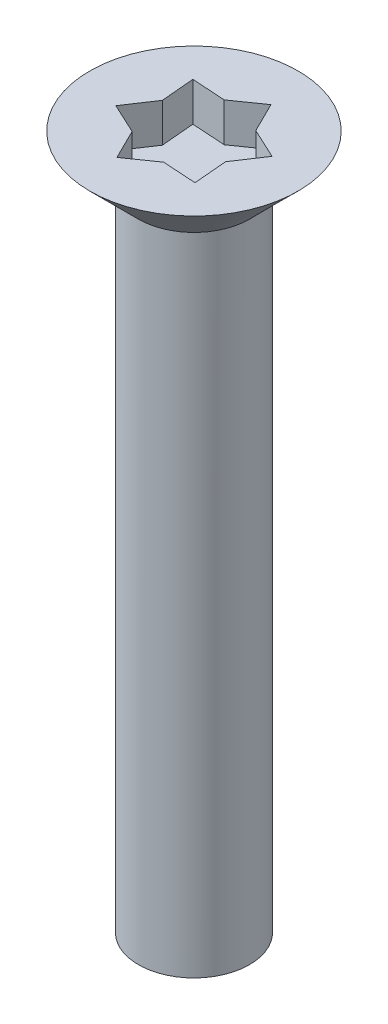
ISO-10303-21;
HEADER;
FILE_DESCRIPTION(('STEP AP214'),'2;1');
FILE_NAME('part.step','',(''),(''),'','','');
FILE_SCHEMA(('AUTOMOTIVE_DESIGN { 1 0 10303 214 1 1 1 1 }'));
ENDSEC;
DATA;
#1=APPLICATION_CONTEXT('core data for automotive mechanical design processes');
#2=APPLICATION_PROTOCOL_DEFINITION('international standard','automotive_design',2000,#1);
#3=PRODUCT_CONTEXT('',#1,'mechanical');
#4=PRODUCT('Part','Part','',(#3));
#5=PRODUCT_RELATED_PRODUCT_CATEGORY('part','',(#4));
#6=PRODUCT_DEFINITION_FORMATION('','',#4);
#7=PRODUCT_DEFINITION_CONTEXT('part definition',#1,'design');
#8=PRODUCT_DEFINITION('design','',#6,#7);
#9=PRODUCT_DEFINITION_SHAPE('','',#8);
#10=(LENGTH_UNIT() NAMED_UNIT(*) SI_UNIT(.MILLI.,.METRE.));
#11=(NAMED_UNIT(*) PLANE_ANGLE_UNIT() SI_UNIT($,.RADIAN.));
#12=(NAMED_UNIT(*) SI_UNIT($,.STERADIAN.) SOLID_ANGLE_UNIT());
#13=UNCERTAINTY_MEASURE_WITH_UNIT(LENGTH_MEASURE(1.E-05),#10,'distance_accuracy_value','');
#14=(GEOMETRIC_REPRESENTATION_CONTEXT(3) GLOBAL_UNCERTAINTY_ASSIGNED_CONTEXT((#13)) GLOBAL_UNIT_ASSIGNED_CONTEXT((#10,
#11,#12)) REPRESENTATION_CONTEXT('',''));
#15=CARTESIAN_POINT('',(0.,0.,0.));
#16=DIRECTION('',(0.,0.,1.));
#17=DIRECTION('',(1.,0.,0.));
#18=AXIS2_PLACEMENT_3D('',#15,#16,#17);
#19=CARTESIAN_POINT('',(2.19556341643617,-1.40000000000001,-0.616712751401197));
#20=DIRECTION('',(0.,1.,0.));
#21=DIRECTION('',(0.,0.,1.));
#22=AXIS2_PLACEMENT_3D('',#19,#20,#21);
#23=PLANE('',#22);
#24=DIRECTION('',(-0.818950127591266,0.,0.573864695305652));
#25=VECTOR('',#24,1.);
#26=CARTESIAN_POINT('',(-0.42591900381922,-1.40000000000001,-1.51631724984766));
#27=LINE('',#26,#25);
#28=CARTESIAN_POINT('',(0.563692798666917,-1.40000000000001,-2.20977006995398));
#29=VERTEX_POINT('',#28);
#30=CARTESIAN_POINT('',(-0.425919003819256,-1.40000000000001,-1.51631724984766));
#31=VERTEX_POINT('',#30);
#32=EDGE_CURVE('E109',#29,#31,#27,.T.);
#33=ORIENTED_EDGE('',*,*,#32,.T.);
#34=DIRECTION('',(-0.997981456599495,0.,-0.0635060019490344));
#35=VECTOR('',#34,1.);
#36=CARTESIAN_POINT('',(-1.6318706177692,-1.40000000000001,-1.59305731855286));
#37=LINE('',#36,#35);
#38=CARTESIAN_POINT('',(-1.63187061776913,-1.40000000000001,-1.59305731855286));
#39=VERTEX_POINT('',#38);
#40=EDGE_CURVE('E106',#31,#39,#37,.T.);
#41=ORIENTED_EDGE('',*,*,#40,.T.);
#42=DIRECTION('',(0.0875063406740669,0.,0.996163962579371));
#43=VECTOR('',#42,1.);
#44=CARTESIAN_POINT('',(-1.52612876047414,-1.40000000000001,-0.389301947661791));
#45=LINE('',#44,#43);
#46=CARTESIAN_POINT('',(-1.52612876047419,-1.40000000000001,-0.389301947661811));
#47=VERTEX_POINT('',#46);
#48=EDGE_CURVE('E103',#39,#47,#45,.T.);
#49=ORIENTED_EDGE('',*,*,#48,.T.);
#50=DIRECTION('',(-0.553988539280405,0.,0.832524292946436));
#51=VECTOR('',#50,1.);
#52=CARTESIAN_POINT('',(-2.19556341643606,-1.40000000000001,0.616712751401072));
#53=LINE('',#52,#51);
#54=CARTESIAN_POINT('',(-2.19556341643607,-1.40000000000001,0.616712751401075));
#55=VERTEX_POINT('',#54);
#56=EDGE_CURVE('E120',#47,#55,#53,.T.);
#57=ORIENTED_EDGE('',*,*,#56,.T.);
#58=DIRECTION('',(0.906456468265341,0.,0.422299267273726));
#59=VECTOR('',#58,1.);
#60=CARTESIAN_POINT('',(-1.10020975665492,-1.40000000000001,1.12701530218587));
#61=LINE('',#60,#59);
#62=CARTESIAN_POINT('',(-1.10020975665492,-1.40000000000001,1.12701530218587));
#63=VERTEX_POINT('',#62);
#64=EDGE_CURVE('E130',#55,#63,#61,.T.);
#65=ORIENTED_EDGE('',*,*,#64,.T.);
#66=DIRECTION('',(0.443992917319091,0.,0.896030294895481));
#67=VECTOR('',#66,1.);
#68=CARTESIAN_POINT('',(-0.563692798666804,-1.40000000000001,2.20977006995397));
#69=LINE('',#68,#67);
#70=CARTESIAN_POINT('',(-0.563692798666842,-1.40000000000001,2.20977006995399));
#71=VERTEX_POINT('',#70);
#72=EDGE_CURVE('E135',#63,#71,#69,.T.);
#73=ORIENTED_EDGE('',*,*,#72,.T.);
#74=DIRECTION('',(0.818950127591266,0.,-0.573864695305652));
#75=VECTOR('',#74,1.);
#76=CARTESIAN_POINT('',(0.425919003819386,-1.40000000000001,1.51631724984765));
#77=LINE('',#76,#75);
#78=CARTESIAN_POINT('',(0.425919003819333,-1.40000000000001,1.51631724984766));
#79=VERTEX_POINT('',#78);
#80=EDGE_CURVE('E140',#71,#79,#77,.T.);
#81=ORIENTED_EDGE('',*,*,#80,.T.);
#82=DIRECTION('',(0.997981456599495,0.,0.0635060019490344));
#83=VECTOR('',#82,1.);
#84=CARTESIAN_POINT('',(1.63187061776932,-1.40000000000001,1.59305731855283));
#85=LINE('',#84,#83);
#86=CARTESIAN_POINT('',(1.63187061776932,-1.40000000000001,1.59305731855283));
#87=VERTEX_POINT('',#86);
#88=EDGE_CURVE('E145',#79,#87,#85,.T.);
#89=ORIENTED_EDGE('',*,*,#88,.T.);
#90=DIRECTION('',(-0.087506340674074,0.,-0.99616396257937));
#91=VECTOR('',#90,1.);
#92=CARTESIAN_POINT('',(1.52612876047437,-1.40000000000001,0.389301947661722));
#93=LINE('',#92,#91);
#94=CARTESIAN_POINT('',(1.52612876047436,-1.40000000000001,0.389301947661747));
#95=VERTEX_POINT('',#94);
#96=EDGE_CURVE('E150',#87,#95,#93,.T.);
#97=ORIENTED_EDGE('',*,*,#96,.T.);
#98=DIRECTION('',(0.553988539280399,0.,-0.83252429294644));
#99=VECTOR('',#98,1.);
#100=CARTESIAN_POINT('',(2.19556341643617,-1.40000000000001,-0.616712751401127));
#101=LINE('',#100,#99);
#102=CARTESIAN_POINT('',(2.19556341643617,-1.40000000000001,-0.616712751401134));
#103=VERTEX_POINT('',#102);
#104=EDGE_CURVE('E155',#95,#103,#101,.T.);
#105=ORIENTED_EDGE('',*,*,#104,.T.);
#106=DIRECTION('',(-0.906456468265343,0.,-0.42229926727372));
#107=VECTOR('',#106,1.);
#108=CARTESIAN_POINT('',(1.10020975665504,-1.40000000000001,-1.12701530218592));
#109=LINE('',#108,#107);
#110=CARTESIAN_POINT('',(1.100209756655,-1.40000000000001,-1.1270153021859));
#111=VERTEX_POINT('',#110);
#112=EDGE_CURVE('E160',#103,#111,#109,.T.);
#113=ORIENTED_EDGE('',*,*,#112,.T.);
#114=DIRECTION('',(-0.443992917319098,0.,-0.896030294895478));
#115=VECTOR('',#114,1.);
#116=CARTESIAN_POINT('',(0.563692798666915,-1.40000000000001,-2.20977006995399));
#117=LINE('',#116,#115);
#118=EDGE_CURVE('E165',#111,#29,#117,.T.);
#119=ORIENTED_EDGE('',*,*,#118,.T.);
#120=EDGE_LOOP('',(#33,#41,#49,#57,#65,#73,#81,#89,#97,#105,#113,#119));
#121=FACE_BOUND('',#120,.T.);
#122=ADVANCED_FACE('F17',(#121),#23,.T.);
#123=CARTESIAN_POINT('',(-1.6318706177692,2.3024716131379,-1.59305731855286));
#124=DIRECTION('',(0.0635060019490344,0.,-0.997981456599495));
#125=DIRECTION('',(-0.997981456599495,0.,-0.0635060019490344));
#126=AXIS2_PLACEMENT_3D('',#123,#124,#125);
#127=PLANE('',#126);
#128=DIRECTION('',(-0.997981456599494,0.,-0.0635060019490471));
#129=VECTOR('',#128,1.);
#130=CARTESIAN_POINT('',(-0.42591900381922,0.,-1.51631724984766));
#131=LINE('',#130,#129);
#132=CARTESIAN_POINT('',(-0.425919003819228,0.,-1.51631724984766));
#133=VERTEX_POINT('',#132);
#134=CARTESIAN_POINT('',(-1.63187061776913,0.,-1.59305731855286));
#135=VERTEX_POINT('',#134);
#136=EDGE_CURVE('E117',#133,#135,#131,.T.);
#137=ORIENTED_EDGE('',*,*,#136,.T.);
#138=DIRECTION('',(0.,1.,0.));
#139=VECTOR('',#138,1.);
#140=CARTESIAN_POINT('',(-1.63187061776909,2.30894489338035,-1.59305731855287));
#141=LINE('',#140,#139);
#142=EDGE_CURVE('E114',#135,#39,#141,.F.);
#143=ORIENTED_EDGE('',*,*,#142,.T.);
#144=ORIENTED_EDGE('',*,*,#40,.F.);
#145=DIRECTION('',(0.,1.,0.));
#146=VECTOR('',#145,1.);
#147=CARTESIAN_POINT('',(-0.425919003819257,2.3024716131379,-1.51631724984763));
#148=LINE('',#147,#146);
#149=EDGE_CURVE('E171',#31,#133,#148,.T.);
#150=ORIENTED_EDGE('',*,*,#149,.T.);
#151=EDGE_LOOP('',(#137,#143,#144,#150));
#152=FACE_BOUND('',#151,.T.);
#153=ADVANCED_FACE('F115',(#152),#127,.F.);
#154=CARTESIAN_POINT('',(-1.52612876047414,2.30894489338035,-0.389301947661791));
#155=DIRECTION('',(-0.996163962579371,0.,0.0875063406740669));
#156=DIRECTION('',(0.0875063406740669,0.,0.996163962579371));
#157=AXIS2_PLACEMENT_3D('',#154,#155,#156);
#158=PLANE('',#157);
#159=DIRECTION('',(0.0875063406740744,0.,0.99616396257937));
#160=VECTOR('',#159,1.);
#161=CARTESIAN_POINT('',(-1.63187061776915,0.,-1.59305731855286));
#162=LINE('',#161,#160);
#163=CARTESIAN_POINT('',(-1.52612876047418,0.,-0.389301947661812));
#164=VERTEX_POINT('',#163);
#165=EDGE_CURVE('E176',#135,#164,#162,.T.);
#166=ORIENTED_EDGE('',*,*,#165,.T.);
#167=DIRECTION('',(0.,1.,0.));
#168=VECTOR('',#167,1.);
#169=CARTESIAN_POINT('',(-1.52612876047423,2.30894489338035,-0.389301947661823));
#170=LINE('',#169,#168);
#171=EDGE_CURVE('E124',#164,#47,#170,.F.);
#172=ORIENTED_EDGE('',*,*,#171,.T.);
#173=ORIENTED_EDGE('',*,*,#48,.F.);
#174=ORIENTED_EDGE('',*,*,#142,.F.);
#175=EDGE_LOOP('',(#166,#172,#173,#174));
#176=FACE_BOUND('',#175,.T.);
#177=ADVANCED_FACE('F122',(#176),#158,.F.);
#178=CARTESIAN_POINT('',(-2.19556341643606,2.30894489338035,0.616712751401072));
#179=DIRECTION('',(-0.832524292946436,0.,-0.553988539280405));
#180=DIRECTION('',(-0.553988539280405,0.,0.832524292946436));
#181=AXIS2_PLACEMENT_3D('',#178,#179,#180);
#182=PLANE('',#181);
#183=DIRECTION('',(-0.553988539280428,0.,0.832524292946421));
#184=VECTOR('',#183,1.);
#185=CARTESIAN_POINT('',(-1.5261287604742,0.,-0.389301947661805));
#186=LINE('',#185,#184);
#187=CARTESIAN_POINT('',(-2.19556341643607,0.,0.616712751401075));
#188=VERTEX_POINT('',#187);
#189=EDGE_CURVE('E178',#164,#188,#186,.T.);
#190=ORIENTED_EDGE('',*,*,#189,.T.);
#191=DIRECTION('',(0.,1.,0.));
#192=VECTOR('',#191,1.);
#193=CARTESIAN_POINT('',(-2.19556341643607,2.28053356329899,0.616712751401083));
#194=LINE('',#193,#192);
#195=EDGE_CURVE('E132',#188,#55,#194,.F.);
#196=ORIENTED_EDGE('',*,*,#195,.T.);
#197=ORIENTED_EDGE('',*,*,#56,.F.);
#198=ORIENTED_EDGE('',*,*,#171,.F.);
#199=EDGE_LOOP('',(#190,#196,#197,#198));
#200=FACE_BOUND('',#199,.T.);
#201=ADVANCED_FACE('F253',(#200),#182,.F.);
#202=CARTESIAN_POINT('',(-1.10020975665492,2.28053356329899,1.12701530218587));
#203=DIRECTION('',(-0.422299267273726,0.,0.906456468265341));
#204=DIRECTION('',(0.906456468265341,0.,0.422299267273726));
#205=AXIS2_PLACEMENT_3D('',#202,#203,#204);
#206=PLANE('',#205);
#207=DIRECTION('',(0.906456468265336,0.,0.422299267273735));
#208=VECTOR('',#207,1.);
#209=CARTESIAN_POINT('',(-2.19556341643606,0.,0.616712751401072));
#210=LINE('',#209,#208);
#211=CARTESIAN_POINT('',(-1.10020975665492,0.,1.12701530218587));
#212=VERTEX_POINT('',#211);
#213=EDGE_CURVE('E180',#188,#212,#210,.T.);
#214=ORIENTED_EDGE('',*,*,#213,.T.);
#215=DIRECTION('',(0.,1.,0.));
#216=VECTOR('',#215,1.);
#217=CARTESIAN_POINT('',(-1.10020975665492,2.28053356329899,1.12701530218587));
#218=LINE('',#217,#216);
#219=EDGE_CURVE('E137',#212,#63,#218,.F.);
#220=ORIENTED_EDGE('',*,*,#219,.T.);
#221=ORIENTED_EDGE('',*,*,#64,.F.);
#222=ORIENTED_EDGE('',*,*,#195,.F.);
#223=EDGE_LOOP('',(#214,#220,#221,#222));
#224=FACE_BOUND('',#223,.T.);
#225=ADVANCED_FACE('F250',(#224),#206,.F.);
#226=CARTESIAN_POINT('',(-0.563692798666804,2.28053356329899,2.20977006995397));
#227=DIRECTION('',(-0.896030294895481,0.,0.443992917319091));
#228=DIRECTION('',(0.443992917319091,0.,0.896030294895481));
#229=AXIS2_PLACEMENT_3D('',#226,#227,#228);
#230=PLANE('',#229);
#231=DIRECTION('',(0.443992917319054,0.,0.896030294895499));
#232=VECTOR('',#231,1.);
#233=CARTESIAN_POINT('',(-1.10020975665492,0.,1.12701530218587));
#234=LINE('',#233,#232);
#235=CARTESIAN_POINT('',(-0.563692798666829,0.,2.20977006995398));
#236=VERTEX_POINT('',#235);
#237=EDGE_CURVE('E182',#212,#236,#234,.T.);
#238=ORIENTED_EDGE('',*,*,#237,.T.);
#239=DIRECTION('',(0.,1.,0.));
#240=VECTOR('',#239,1.);
#241=CARTESIAN_POINT('',(-0.563692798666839,2.3024716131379,2.20977006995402));
#242=LINE('',#241,#240);
#243=EDGE_CURVE('E142',#236,#71,#242,.F.);
#244=ORIENTED_EDGE('',*,*,#243,.T.);
#245=ORIENTED_EDGE('',*,*,#72,.F.);
#246=ORIENTED_EDGE('',*,*,#219,.F.);
#247=EDGE_LOOP('',(#238,#244,#245,#246));
#248=FACE_BOUND('',#247,.T.);
#249=ADVANCED_FACE('F246',(#248),#230,.F.);
#250=CARTESIAN_POINT('',(0.425919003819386,2.3024716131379,1.51631724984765));
#251=DIRECTION('',(0.573864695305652,0.,0.818950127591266));
#252=DIRECTION('',(0.818950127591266,0.,-0.573864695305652));
#253=AXIS2_PLACEMENT_3D('',#250,#251,#252);
#254=PLANE('',#253);
#255=DIRECTION('',(0.818950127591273,0.,-0.573864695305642));
#256=VECTOR('',#255,1.);
#257=CARTESIAN_POINT('',(-0.563692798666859,0.,2.20977006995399));
#258=LINE('',#257,#256);
#259=CARTESIAN_POINT('',(0.425919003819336,0.,1.51631724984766));
#260=VERTEX_POINT('',#259);
#261=EDGE_CURVE('E184',#236,#260,#258,.T.);
#262=ORIENTED_EDGE('',*,*,#261,.T.);
#263=DIRECTION('',(0.,1.,0.));
#264=VECTOR('',#263,1.);
#265=CARTESIAN_POINT('',(0.425919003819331,2.3024716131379,1.51631724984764));
#266=LINE('',#265,#264);
#267=EDGE_CURVE('E147',#260,#79,#266,.F.);
#268=ORIENTED_EDGE('',*,*,#267,.T.);
#269=ORIENTED_EDGE('',*,*,#80,.F.);
#270=ORIENTED_EDGE('',*,*,#243,.F.);
#271=EDGE_LOOP('',(#262,#268,#269,#270));
#272=FACE_BOUND('',#271,.T.);
#273=ADVANCED_FACE('F239',(#272),#254,.F.);
#274=CARTESIAN_POINT('',(1.63187061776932,2.3024716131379,1.59305731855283));
#275=DIRECTION('',(-0.0635060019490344,0.,0.997981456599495));
#276=DIRECTION('',(0.997981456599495,0.,0.0635060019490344));
#277=AXIS2_PLACEMENT_3D('',#274,#275,#276);
#278=PLANE('',#277);
#279=DIRECTION('',(0.997981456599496,0.,0.0635060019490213));
#280=VECTOR('',#279,1.);
#281=CARTESIAN_POINT('',(0.425919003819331,0.,1.51631724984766));
#282=LINE('',#281,#280);
#283=CARTESIAN_POINT('',(1.63187061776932,0.,1.59305731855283));
#284=VERTEX_POINT('',#283);
#285=EDGE_CURVE('E186',#260,#284,#282,.T.);
#286=ORIENTED_EDGE('',*,*,#285,.T.);
#287=DIRECTION('',(0.,1.,0.));
#288=VECTOR('',#287,1.);
#289=CARTESIAN_POINT('',(1.63187061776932,2.30894489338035,1.59305731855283));
#290=LINE('',#289,#288);
#291=EDGE_CURVE('E152',#284,#87,#290,.F.);
#292=ORIENTED_EDGE('',*,*,#291,.T.);
#293=ORIENTED_EDGE('',*,*,#88,.F.);
#294=ORIENTED_EDGE('',*,*,#267,.F.);
#295=EDGE_LOOP('',(#286,#292,#293,#294));
#296=FACE_BOUND('',#295,.T.);
#297=ADVANCED_FACE('F235',(#296),#278,.F.);
#298=CARTESIAN_POINT('',(1.52612876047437,2.30894489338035,0.389301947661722));
#299=DIRECTION('',(0.99616396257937,0.,-0.087506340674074));
#300=DIRECTION('',(-0.087506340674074,0.,-0.99616396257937));
#301=AXIS2_PLACEMENT_3D('',#298,#299,#300);
#302=PLANE('',#301);
#303=DIRECTION('',(-0.087506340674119,0.,-0.996163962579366));
#304=VECTOR('',#303,1.);
#305=CARTESIAN_POINT('',(1.63187061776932,0.,1.59305731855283));
#306=LINE('',#305,#304);
#307=CARTESIAN_POINT('',(1.52612876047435,0.,0.389301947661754));
#308=VERTEX_POINT('',#307);
#309=EDGE_CURVE('E188',#284,#308,#306,.T.);
#310=ORIENTED_EDGE('',*,*,#309,.T.);
#311=DIRECTION('',(0.,1.,0.));
#312=VECTOR('',#311,1.);
#313=CARTESIAN_POINT('',(1.52612876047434,2.30894489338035,0.389301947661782));
#314=LINE('',#313,#312);
#315=EDGE_CURVE('E157',#308,#95,#314,.F.);
#316=ORIENTED_EDGE('',*,*,#315,.T.);
#317=ORIENTED_EDGE('',*,*,#96,.F.);
#318=ORIENTED_EDGE('',*,*,#291,.F.);
#319=EDGE_LOOP('',(#310,#316,#317,#318));
#320=FACE_BOUND('',#319,.T.);
#321=ADVANCED_FACE('F231',(#320),#302,.F.);
#322=CARTESIAN_POINT('',(2.19556341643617,2.30894489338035,-0.616712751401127));
#323=DIRECTION('',(0.83252429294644,0.,0.553988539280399));
#324=DIRECTION('',(0.553988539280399,0.,-0.83252429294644));
#325=AXIS2_PLACEMENT_3D('',#322,#323,#324);
#326=PLANE('',#325);
#327=DIRECTION('',(0.553988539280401,0.,-0.832524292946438));
#328=VECTOR('',#327,1.);
#329=CARTESIAN_POINT('',(1.52612876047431,0.,0.389301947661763));
#330=LINE('',#329,#328);
#331=CARTESIAN_POINT('',(2.19556341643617,0.,-0.616712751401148));
#332=VERTEX_POINT('',#331);
#333=EDGE_CURVE('E190',#308,#332,#330,.T.);
#334=ORIENTED_EDGE('',*,*,#333,.T.);
#335=DIRECTION('',(0.,1.,0.));
#336=VECTOR('',#335,1.);
#337=CARTESIAN_POINT('',(2.19556341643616,2.28053356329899,-0.616712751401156));
#338=LINE('',#337,#336);
#339=EDGE_CURVE('E162',#332,#103,#338,.F.);
#340=ORIENTED_EDGE('',*,*,#339,.T.);
#341=ORIENTED_EDGE('',*,*,#104,.F.);
#342=ORIENTED_EDGE('',*,*,#315,.F.);
#343=EDGE_LOOP('',(#334,#340,#341,#342));
#344=FACE_BOUND('',#343,.T.);
#345=ADVANCED_FACE('F224',(#344),#326,.F.);
#346=CARTESIAN_POINT('',(1.10020975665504,2.28053356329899,-1.12701530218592));
#347=DIRECTION('',(0.42229926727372,0.,-0.906456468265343));
#348=DIRECTION('',(-0.906456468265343,0.,-0.42229926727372));
#349=AXIS2_PLACEMENT_3D('',#346,#347,#348);
#350=PLANE('',#349);
#351=DIRECTION('',(-0.90645646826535,0.,-0.422299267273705));
#352=VECTOR('',#351,1.);
#353=CARTESIAN_POINT('',(2.19556341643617,0.,-0.616712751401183));
#354=LINE('',#353,#352);
#355=CARTESIAN_POINT('',(1.10020975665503,0.,-1.12701530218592));
#356=VERTEX_POINT('',#355);
#357=EDGE_CURVE('E192',#332,#356,#354,.T.);
#358=ORIENTED_EDGE('',*,*,#357,.T.);
#359=DIRECTION('',(0.,1.,0.));
#360=VECTOR('',#359,1.);
#361=CARTESIAN_POINT('',(1.10020975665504,2.28053356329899,-1.12701530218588));
#362=LINE('',#361,#360);
#363=EDGE_CURVE('E167',#356,#111,#362,.F.);
#364=ORIENTED_EDGE('',*,*,#363,.T.);
#365=ORIENTED_EDGE('',*,*,#112,.F.);
#366=ORIENTED_EDGE('',*,*,#339,.F.);
#367=EDGE_LOOP('',(#358,#364,#365,#366));
#368=FACE_BOUND('',#367,.T.);
#369=ADVANCED_FACE('F222',(#368),#350,.F.);
#370=CARTESIAN_POINT('',(0.563692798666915,2.28053356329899,-2.20977006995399));
#371=DIRECTION('',(0.896030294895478,0.,-0.443992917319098));
#372=DIRECTION('',(-0.443992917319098,0.,-0.896030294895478));
#373=AXIS2_PLACEMENT_3D('',#370,#371,#372);
#374=PLANE('',#373);
#375=DIRECTION('',(-0.443992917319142,0.,-0.896030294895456));
#376=VECTOR('',#375,1.);
#377=CARTESIAN_POINT('',(1.10020975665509,0.,-1.12701530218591));
#378=LINE('',#377,#376);
#379=CARTESIAN_POINT('',(0.563692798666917,0.,-2.20977006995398));
#380=VERTEX_POINT('',#379);
#381=EDGE_CURVE('E34',#356,#380,#378,.T.);
#382=ORIENTED_EDGE('',*,*,#381,.T.);
#383=DIRECTION('',(0.,1.,0.));
#384=VECTOR('',#383,1.);
#385=CARTESIAN_POINT('',(0.563692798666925,2.3024716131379,-2.20977006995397));
#386=LINE('',#385,#384);
#387=EDGE_CURVE('E173',#380,#29,#386,.F.);
#388=ORIENTED_EDGE('',*,*,#387,.T.);
#389=ORIENTED_EDGE('',*,*,#118,.F.);
#390=ORIENTED_EDGE('',*,*,#363,.F.);
#391=EDGE_LOOP('',(#382,#388,#389,#390));
#392=FACE_BOUND('',#391,.T.);
#393=ADVANCED_FACE('F217',(#392),#374,.F.);
#394=CARTESIAN_POINT('',(-0.42591900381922,2.3024716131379,-1.51631724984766));
#395=DIRECTION('',(-0.573864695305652,0.,-0.818950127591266));
#396=DIRECTION('',(-0.818950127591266,0.,0.573864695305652));
#397=AXIS2_PLACEMENT_3D('',#394,#395,#396);
#398=PLANE('',#397);
#399=DIRECTION('',(-0.818950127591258,0.,0.573864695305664));
#400=VECTOR('',#399,1.);
#401=CARTESIAN_POINT('',(0.563692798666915,0.,-2.20977006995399));
#402=LINE('',#401,#400);
#403=EDGE_CURVE('E195',#380,#133,#402,.T.);
#404=ORIENTED_EDGE('',*,*,#403,.T.);
#405=ORIENTED_EDGE('',*,*,#149,.F.);
#406=ORIENTED_EDGE('',*,*,#32,.F.);
#407=ORIENTED_EDGE('',*,*,#387,.F.);
#408=EDGE_LOOP('',(#404,#405,#406,#407));
#409=FACE_BOUND('',#408,.T.);
#410=ADVANCED_FACE('F210',(#409),#398,.F.);
#411=CARTESIAN_POINT('',(0.,0.,0.));
#412=DIRECTION('',(0.,-1.,0.));
#413=DIRECTION('',(0.,0.,-1.));
#414=AXIS2_PLACEMENT_3D('',#411,#412,#413);
#415=PLANE('',#414);
#416=CARTESIAN_POINT('',(0.,-5.6843418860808E-11,0.));
#417=DIRECTION('',(0.,1.,0.));
#418=DIRECTION('',(0.,0.,1.));
#419=AXIS2_PLACEMENT_3D('',#416,#417,#418);
#420=CIRCLE('',#419,3.74999999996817);
#421=CARTESIAN_POINT('',(0.,-5.68434188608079E-11,3.74999999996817));
#422=VERTEX_POINT('',#421);
#423=EDGE_CURVE('E20',#422,#422,#420,.F.);
#424=ORIENTED_EDGE('',*,*,#423,.F.);
#425=EDGE_LOOP('',(#424));
#426=FACE_BOUND('',#425,.T.);
#427=ORIENTED_EDGE('',*,*,#381,.F.);
#428=ORIENTED_EDGE('',*,*,#357,.F.);
#429=ORIENTED_EDGE('',*,*,#333,.F.);
#430=ORIENTED_EDGE('',*,*,#309,.F.);
#431=ORIENTED_EDGE('',*,*,#285,.F.);
#432=ORIENTED_EDGE('',*,*,#261,.F.);
#433=ORIENTED_EDGE('',*,*,#237,.F.);
#434=ORIENTED_EDGE('',*,*,#213,.F.);
#435=ORIENTED_EDGE('',*,*,#189,.F.);
#436=ORIENTED_EDGE('',*,*,#165,.F.);
#437=ORIENTED_EDGE('',*,*,#136,.F.);
#438=ORIENTED_EDGE('',*,*,#403,.F.);
#439=EDGE_LOOP('',(#427,#428,#429,#430,#431,#432,#433,#434,#435,#436,#437,#438));
#440=FACE_BOUND('',#439,.T.);
#441=ADVANCED_FACE('F207',(#426,#440),#415,.F.);
#442=CARTESIAN_POINT('',(0.,-1.13686837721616E-10,0.));
#443=DIRECTION('',(0.,1.,0.));
#444=DIRECTION('',(0.,0.,1.));
#445=AXIS2_PLACEMENT_3D('',#442,#443,#444);
#446=CONICAL_SURFACE('',#445,3.74999999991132,0.785398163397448);
#447=ORIENTED_EDGE('',*,*,#423,.T.);
#448=EDGE_LOOP('',(#447));
#449=FACE_BOUND('',#448,.T.);
#450=CARTESIAN_POINT('',(0.,-1.74999999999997,0.));
#451=DIRECTION('',(0.,-1.,0.));
#452=DIRECTION('',(0.,0.,-1.));
#453=AXIS2_PLACEMENT_3D('',#450,#451,#452);
#454=CIRCLE('',#453,2.);
#455=CARTESIAN_POINT('',(0.,-1.74999999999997,-2.));
#456=VERTEX_POINT('',#455);
#457=EDGE_CURVE('E26',#456,#456,#454,.T.);
#458=ORIENTED_EDGE('',*,*,#457,.F.);
#459=EDGE_LOOP('',(#458));
#460=FACE_BOUND('',#459,.T.);
#461=ADVANCED_FACE('F204',(#449,#460),#446,.T.);
#462=CARTESIAN_POINT('',(-1.99999999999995,-25.,0.));
#463=DIRECTION('',(0.,1.,0.));
#464=DIRECTION('',(0.,0.,1.));
#465=AXIS2_PLACEMENT_3D('',#462,#463,#464);
#466=PLANE('',#465);
#467=CARTESIAN_POINT('',(0.,-25.,0.));
#468=DIRECTION('',(0.,-1.,0.));
#469=DIRECTION('',(0.,0.,-1.));
#470=AXIS2_PLACEMENT_3D('',#467,#468,#469);
#471=CIRCLE('',#470,2.);
#472=CARTESIAN_POINT('',(0.,-25.,-2.));
#473=VERTEX_POINT('',#472);
#474=EDGE_CURVE('E11',#473,#473,#471,.F.);
#475=ORIENTED_EDGE('',*,*,#474,.F.);
#476=EDGE_LOOP('',(#475));
#477=FACE_BOUND('',#476,.T.);
#478=ADVANCED_FACE('F265',(#477),#466,.F.);
#479=CARTESIAN_POINT('',(0.,0.,0.));
#480=DIRECTION('',(0.,-1.,0.));
#481=DIRECTION('',(0.,0.,-1.));
#482=AXIS2_PLACEMENT_3D('',#479,#480,#481);
#483=CYLINDRICAL_SURFACE('',#482,2.);
#484=ORIENTED_EDGE('',*,*,#474,.T.);
#485=EDGE_LOOP('',(#484));
#486=FACE_BOUND('',#485,.T.);
#487=ORIENTED_EDGE('',*,*,#457,.T.);
#488=EDGE_LOOP('',(#487));
#489=FACE_BOUND('',#488,.T.);
#490=ADVANCED_FACE('F263',(#486,#489),#483,.T.);
#491=CLOSED_SHELL('',(#122,#153,#177,#201,#225,#249,#273,#297,#321,#345,#369,#393,#410,#441,
#461,#478,#490));
#492=MANIFOLD_SOLID_BREP('B1',#491);
#493=ADVANCED_BREP_SHAPE_REPRESENTATION('',(#18,#492),#14);
#494=SHAPE_DEFINITION_REPRESENTATION(#9,#493);
ENDSEC;
END-ISO-10303-21;
